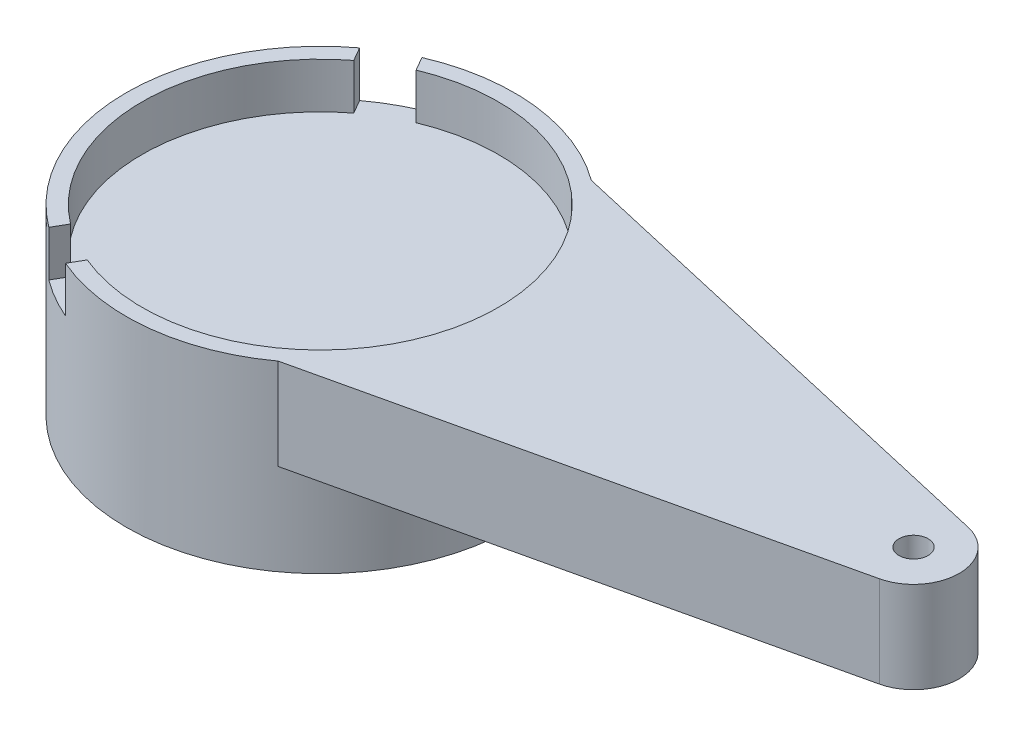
from build123d import *
from build123d.topology import SkipClean

# Parameters (mm, degrees)
BOSS_EXTRUDE1_DEPTH   = 5
SKETCH3_R             = 9.76
CUT_EXTRUDE1_DEPTH    = 2.5
M2X0_4_TAPPED_HOLE1_D = 1.6
CUT_EXTRUDE2_DEPTH    = 2.5
BOSS_EXTRUDE2_START   = -5
SKETCH11_R            = 10.625
SKETCH11_R_2          = 6.5
BOSS_EXTRUDE2_DEPTH   = 5


with BuildPart() as part:
    # Sketch2 → Boss-Extrude1 (new body)
    with BuildSketch(Plane(origin=(0, 0, 0), x_dir=(1, 0, 0), z_dir=(0, 1, 0))):
        with BuildLine():
            Line((33.058461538, -2.43682595), (6.273291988, -8.575338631))
            ThreePointArc((6.273291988, -8.575338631), (-10.625, 0), (6.273291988, 8.575338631))
            Line((6.273291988, 8.575338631), (33.058461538, 2.43682595))
            ThreePointArc((33.058461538, 2.43682595), (35, 0), (33.058461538, -2.43682595))
        make_face()
    extrude(amount=BOSS_EXTRUDE1_DEPTH)

    # Sketch3 → Cut-Extrude1 (cut)
    with BuildSketch(Plane(origin=(0, 5, 0), x_dir=(1, 0, 0), z_dir=(0, 1, 0))):
        with Locations(Location((0, 0, 0), (0, 0, 270))):
            Circle(SKETCH3_R)
    extrude(amount=-CUT_EXTRUDE1_DEPTH, mode=Mode.SUBTRACT)

    # M2x0.4 Tapped Hole1 (through all)
    with Locations(Plane(origin=(0, 5, 0), x_dir=(1, 0, 0), z_dir=(0, 1, 0))):
        with Locations((32.5, 0)):
            Hole(M2X0_4_TAPPED_HOLE1_D / 2)

    # Sketch8 → Cut-Extrude2 (cut)
    with BuildSketch(Plane(origin=(0, 5, 0), x_dir=(1, 0, 0), z_dir=(0, 1, 0))):
        with BuildLine():
            Line((-4.193075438, 9.762619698), (-3.757279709, 9.007799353))
            ThreePointArc((-3.757279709, 9.007799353), (-4.88, 8.452407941), (-5.922343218, 7.757799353))
            Line((-5.922343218, 7.757799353), (-6.358138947, 8.512619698))
            ThreePointArc((-6.358138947, 8.512619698), (-5.3125, 9.201519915), (-4.193075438, 9.762619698))
        make_face()
        with BuildLine():
            Line((-3.757279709, -9.007799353), (-4.193075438, -9.762619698))
            ThreePointArc((-4.193075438, -9.762619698), (-5.3125, -9.201519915), (-6.358138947, -8.512619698))
            Line((-6.358138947, -8.512619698), (-5.922343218, -7.757799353))
            ThreePointArc((-5.922343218, -7.757799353), (-4.88, -8.452407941), (-3.757279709, -9.007799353))
        make_face()
    extrude(amount=-CUT_EXTRUDE2_DEPTH, mode=Mode.SUBTRACT)

    # Sketch11 → Boss-Extrude2 (add)
    with SkipClean():  # the faces are left unmerged after this step: merging them gives an invalid solid
        with BuildSketch(Plane(origin=(0, 0, 0), x_dir=(1, 0, 0), z_dir=(0, 1, 0)).offset(BOSS_EXTRUDE2_START)):
            with Locations(Location((0, 0, 0), (0, 0, 113.243672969))):
                Circle(SKETCH11_R)
            with Locations(Location((0, 0, 0), (0, 0, 270))):
                Circle(SKETCH11_R_2, mode=Mode.SUBTRACT)
        extrude(amount=BOSS_EXTRUDE2_DEPTH)


solid = part.part
